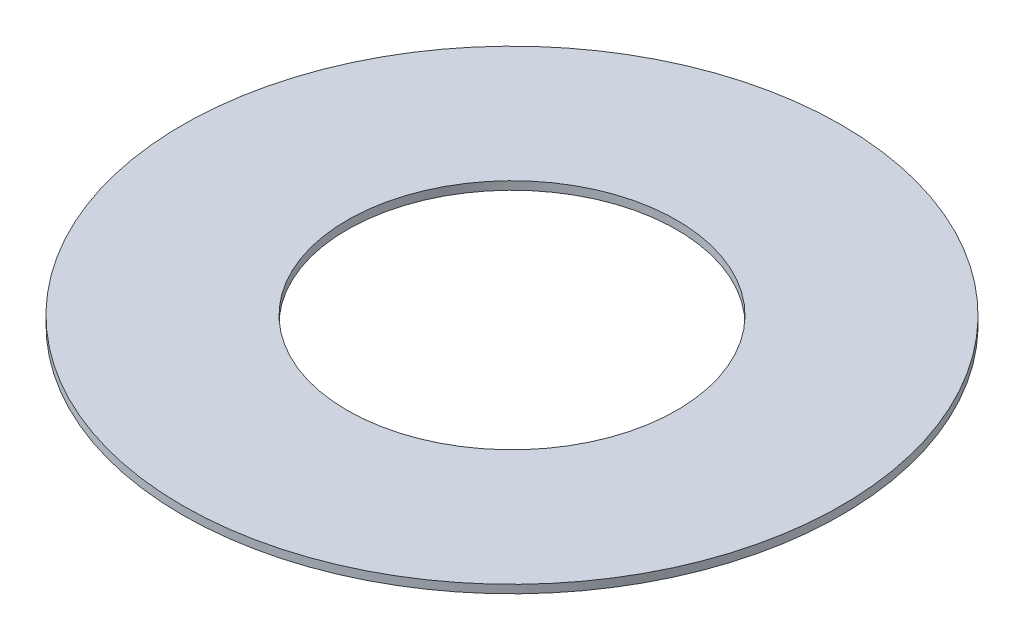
from build123d import *

# Parameters (mm, degrees)
SKETCH1_R           = 101.6
SKETCH1_R_2         = 50.8
BOSS_EXTRUDE1_DEPTH = 2.54


with BuildPart() as part:
    # Sketch1 → Boss-Extrude1 (new body)
    with BuildSketch(Plane(origin=(0, 0, 0), x_dir=(1, 0, 0), z_dir=(0, 1, 0))):
        with Locations(Location((0, 0, 0), (0, 0, 270))):
            Circle(SKETCH1_R)
        with Locations(Location((0, 0, 0), (0, 0, 270))):
            Circle(SKETCH1_R_2, mode=Mode.SUBTRACT)
    extrude(amount=BOSS_EXTRUDE1_DEPTH)


solid = part.part
